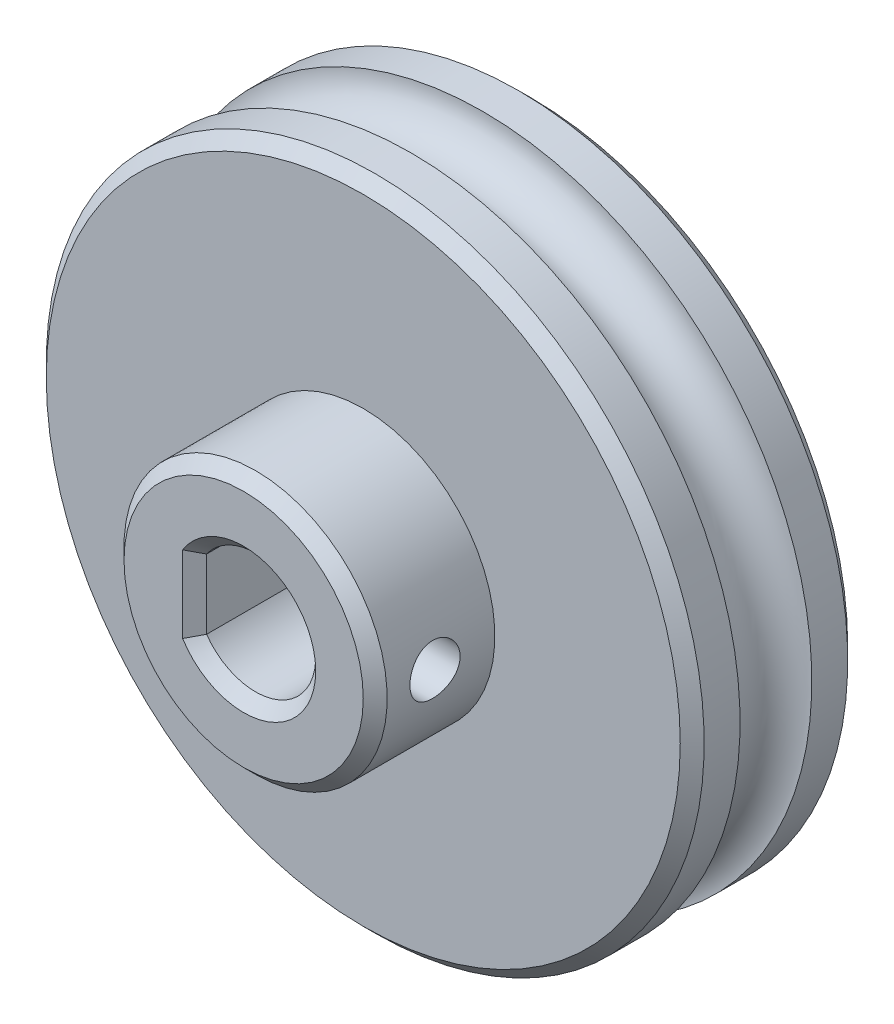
ISO-10303-21;
HEADER;
FILE_DESCRIPTION(('STEP AP214'),'2;1');
FILE_NAME('part.step','',(''),(''),'','','');
FILE_SCHEMA(('AUTOMOTIVE_DESIGN { 1 0 10303 214 1 1 1 1 }'));
ENDSEC;
DATA;
#1=APPLICATION_CONTEXT('core data for automotive mechanical design processes');
#2=APPLICATION_PROTOCOL_DEFINITION('international standard','automotive_design',2000,#1);
#3=PRODUCT_CONTEXT('',#1,'mechanical');
#4=PRODUCT('Part','Part','',(#3));
#5=PRODUCT_RELATED_PRODUCT_CATEGORY('part','',(#4));
#6=PRODUCT_DEFINITION_FORMATION('','',#4);
#7=PRODUCT_DEFINITION_CONTEXT('part definition',#1,'design');
#8=PRODUCT_DEFINITION('design','',#6,#7);
#9=PRODUCT_DEFINITION_SHAPE('','',#8);
#10=(LENGTH_UNIT() NAMED_UNIT(*) SI_UNIT(.MILLI.,.METRE.));
#11=(NAMED_UNIT(*) PLANE_ANGLE_UNIT() SI_UNIT($,.RADIAN.));
#12=(NAMED_UNIT(*) SI_UNIT($,.STERADIAN.) SOLID_ANGLE_UNIT());
#13=UNCERTAINTY_MEASURE_WITH_UNIT(LENGTH_MEASURE(1.E-05),#10,'distance_accuracy_value','');
#14=(GEOMETRIC_REPRESENTATION_CONTEXT(3) GLOBAL_UNCERTAINTY_ASSIGNED_CONTEXT((#13)) GLOBAL_UNIT_ASSIGNED_CONTEXT((#10,
#11,#12)) REPRESENTATION_CONTEXT('',''));
#15=CARTESIAN_POINT('',(0.,0.,0.));
#16=DIRECTION('',(0.,0.,1.));
#17=DIRECTION('',(1.,0.,0.));
#18=AXIS2_PLACEMENT_3D('',#15,#16,#17);
#19=CARTESIAN_POINT('',(0.,0.,85.9712445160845));
#20=DIRECTION('',(0.,0.,1.));
#21=DIRECTION('',(0.,-1.,0.));
#22=AXIS2_PLACEMENT_3D('',#19,#20,#21);
#23=CYLINDRICAL_SURFACE('',#22,11.);
#24=CARTESIAN_POINT('',(0.,0.,14.));
#25=DIRECTION('',(0.,0.,1.));
#26=DIRECTION('',(0.,-1.,0.));
#27=AXIS2_PLACEMENT_3D('',#24,#25,#26);
#28=CIRCLE('',#27,11.);
#29=CARTESIAN_POINT('',(0.,-11.,14.));
#30=VERTEX_POINT('',#29);
#31=EDGE_CURVE('E283',#30,#30,#28,.T.);
#32=ORIENTED_EDGE('',*,*,#31,.T.);
#33=EDGE_LOOP('',(#32));
#34=FACE_BOUND('',#33,.T.);
#35=CARTESIAN_POINT('',(0.,0.,23.));
#36=DIRECTION('',(0.,0.,1.));
#37=DIRECTION('',(0.,-1.,0.));
#38=AXIS2_PLACEMENT_3D('',#35,#36,#37);
#39=CIRCLE('',#38,11.);
#40=CARTESIAN_POINT('',(0.,-11.,23.));
#41=VERTEX_POINT('',#40);
#42=EDGE_CURVE('E251',#41,#41,#39,.F.);
#43=ORIENTED_EDGE('',*,*,#42,.T.);
#44=EDGE_LOOP('',(#43));
#45=FACE_BOUND('',#44,.T.);
#46=CARTESIAN_POINT('',(11.,0.,21.1));
#47=CARTESIAN_POINT('',(10.9999978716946,-0.116820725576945,21.0999955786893));
#48=CARTESIAN_POINT('',(10.9981198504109,-0.233698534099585,21.0902191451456));
#49=CARTESIAN_POINT('',(10.9908091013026,-0.46415790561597,21.0513984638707));
#50=CARTESIAN_POINT('',(10.9853734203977,-0.577736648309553,21.022338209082));
#51=CARTESIAN_POINT('',(10.971555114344,-0.798231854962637,20.9458743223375));
#52=CARTESIAN_POINT('',(10.9631751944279,-0.90515432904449,20.8984875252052));
#53=CARTESIAN_POINT('',(10.9443823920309,-1.10952197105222,20.7867640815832));
#54=CARTESIAN_POINT('',(10.9339696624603,-1.20696785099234,20.7224287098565));
#55=CARTESIAN_POINT('',(10.9121153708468,-1.39083315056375,20.5777881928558));
#56=CARTESIAN_POINT('',(10.9006636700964,-1.47711814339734,20.4973136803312));
#57=CARTESIAN_POINT('',(10.8780969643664,-1.63504914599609,20.3230435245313));
#58=CARTESIAN_POINT('',(10.8669819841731,-1.70669408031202,20.2292469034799));
#59=CARTESIAN_POINT('',(10.846248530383,-1.83387383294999,20.0300405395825));
#60=CARTESIAN_POINT('',(10.8366431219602,-1.88927125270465,19.9245415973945));
#61=CARTESIAN_POINT('',(10.8201595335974,-1.98150370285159,19.7055201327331));
#62=CARTESIAN_POINT('',(10.8132811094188,-2.01834039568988,19.5919983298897));
#63=CARTESIAN_POINT('',(10.8031324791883,-2.07197297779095,19.3615941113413));
#64=CARTESIAN_POINT('',(10.7998200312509,-2.08900368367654,19.2447682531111));
#65=CARTESIAN_POINT('',(10.7970511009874,-2.10326984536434,19.0098739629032));
#66=CARTESIAN_POINT('',(10.7975942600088,-2.10050714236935,18.8918056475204));
#67=CARTESIAN_POINT('',(10.8024367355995,-2.07545516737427,18.6594836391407));
#68=CARTESIAN_POINT('',(10.8066845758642,-2.05343348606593,18.5451998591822));
#69=CARTESIAN_POINT('',(10.8183768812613,-1.99091034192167,18.3219793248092));
#70=CARTESIAN_POINT('',(10.8258214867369,-1.95040806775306,18.213042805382));
#71=CARTESIAN_POINT('',(10.8431219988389,-1.85181340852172,18.0028292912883));
#72=CARTESIAN_POINT('',(10.8529925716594,-1.79361350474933,17.901603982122));
#73=CARTESIAN_POINT('',(10.8740232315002,-1.66135166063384,17.7102553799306));
#74=CARTESIAN_POINT('',(10.8851834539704,-1.58728805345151,17.6201332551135));
#75=CARTESIAN_POINT('',(10.9077598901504,-1.42396113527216,17.4520037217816));
#76=CARTESIAN_POINT('',(10.9191773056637,-1.33446907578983,17.3742185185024));
#77=CARTESIAN_POINT('',(10.9408141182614,-1.14358963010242,17.2347307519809));
#78=CARTESIAN_POINT('',(10.9510335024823,-1.04220211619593,17.1730283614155));
#79=CARTESIAN_POINT('',(10.9691445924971,-0.830173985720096,17.0674227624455));
#80=CARTESIAN_POINT('',(10.9770331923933,-0.719521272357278,17.0235432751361));
#81=CARTESIAN_POINT('',(10.9895700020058,-0.49223122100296,16.9550569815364));
#82=CARTESIAN_POINT('',(10.994218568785,-0.37559454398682,16.9304480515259));
#83=CARTESIAN_POINT('',(10.9997023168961,-0.141558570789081,16.9015121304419));
#84=CARTESIAN_POINT('',(11.0005947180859,-0.0241982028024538,16.8968807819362));
#85=CARTESIAN_POINT('',(10.9986238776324,0.209619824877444,16.9072142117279));
#86=CARTESIAN_POINT('',(10.9957608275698,0.326077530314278,16.9221779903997));
#87=CARTESIAN_POINT('',(10.9866364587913,0.553814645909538,16.9710239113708));
#88=CARTESIAN_POINT('',(10.9804029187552,0.665128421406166,17.0047514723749));
#89=CARTESIAN_POINT('',(10.9652337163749,0.880521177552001,17.0899998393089));
#90=CARTESIAN_POINT('',(10.9562978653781,0.984599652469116,17.1415218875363));
#91=CARTESIAN_POINT('',(10.9365725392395,1.18386224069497,17.2615662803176));
#92=CARTESIAN_POINT('',(10.9257632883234,1.27893275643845,17.3302738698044));
#93=CARTESIAN_POINT('',(10.9035399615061,1.45630391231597,17.4824890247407));
#94=CARTESIAN_POINT('',(10.8921258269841,1.53860331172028,17.5659980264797));
#95=CARTESIAN_POINT('',(10.8697885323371,1.68925742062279,17.7468254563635));
#96=CARTESIAN_POINT('',(10.8588743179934,1.7574040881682,17.8443185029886));
#97=CARTESIAN_POINT('',(10.8389551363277,1.87635388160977,18.0495468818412));
#98=CARTESIAN_POINT('',(10.8299500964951,1.92715766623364,18.157281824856));
#99=CARTESIAN_POINT('',(10.8149396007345,2.00968750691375,18.3794169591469));
#100=CARTESIAN_POINT('',(10.8089194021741,2.04150748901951,18.4937812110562));
#101=CARTESIAN_POINT('',(10.8005271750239,2.08545491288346,18.7263589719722));
#102=CARTESIAN_POINT('',(10.7981547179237,2.09758466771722,18.844572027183));
#103=CARTESIAN_POINT('',(10.7973488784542,2.10172771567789,19.0794065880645));
#104=CARTESIAN_POINT('',(10.7988512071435,2.09406932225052,19.1960222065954));
#105=CARTESIAN_POINT('',(10.8054828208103,2.0595738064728,19.4262709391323));
#106=CARTESIAN_POINT('',(10.8106120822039,2.03273680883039,19.5399040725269));
#107=CARTESIAN_POINT('',(10.8238920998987,1.96078655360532,19.7607769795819));
#108=CARTESIAN_POINT('',(10.8320367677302,1.91571010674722,19.8680291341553));
#109=CARTESIAN_POINT('',(10.8504339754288,1.80859687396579,20.0735005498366));
#110=CARTESIAN_POINT('',(10.8606866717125,1.74655882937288,20.1717191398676));
#111=CARTESIAN_POINT('',(10.882343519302,1.60614737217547,20.3579773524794));
#112=CARTESIAN_POINT('',(10.8937630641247,1.5275355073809,20.4458354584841));
#113=CARTESIAN_POINT('',(10.9163530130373,1.35670385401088,20.6072225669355));
#114=CARTESIAN_POINT('',(10.9275233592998,1.26448094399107,20.6807482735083));
#115=CARTESIAN_POINT('',(10.9484794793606,1.06800710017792,20.8120301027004));
#116=CARTESIAN_POINT('',(10.9582512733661,0.963651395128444,20.8696317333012));
#117=CARTESIAN_POINT('',(10.9751724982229,0.746588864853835,20.966392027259));
#118=CARTESIAN_POINT('',(10.9823243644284,0.633889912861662,21.0055678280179));
#119=CARTESIAN_POINT('',(10.9917600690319,0.434066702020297,21.056507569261));
#120=CARTESIAN_POINT('',(10.9948324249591,0.348102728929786,21.0727890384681));
#121=CARTESIAN_POINT('',(10.9989531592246,0.174769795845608,21.0945367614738));
#122=CARTESIAN_POINT('',(11.0000015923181,0.0874008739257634,21.1000033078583));
#123=CARTESIAN_POINT('',(11.,0.,21.1));
#124=B_SPLINE_CURVE_WITH_KNOTS('',3,(#46,#47,#48,#49,#50,#51,#52,#53,#54,#55,#56,#57,#58,#59,
#60,#61,#62,#63,#64,#65,#66,#67,#68,#69,#70,#71,#72,#73,#74,#75,#76,#77,#78,#79,#80,#81,#82,#83,
#84,#85,#86,#87,#88,#89,#90,#91,#92,#93,#94,#95,#96,#97,#98,#99,#100,#101,#102,#103,#104,#105,
#106,#107,#108,#109,#110,#111,#112,#113,#114,#115,#116,#117,#118,#119,#120,#121,#122,#123),
.UNSPECIFIED.,.T.,.F.,(4,2,2,2,2,2,2,2,2,2,2,2,2,2,2,2,2,2,2,2,2,2,2,2,2,2,2,2,2,2,2,2,2,2,2,2,
2,2,4),(0.,0.350142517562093,0.700576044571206,1.05068842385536,1.40077447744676,
1.75474719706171,2.10874590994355,2.46565720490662,2.82253652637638,3.17514016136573,
3.52771099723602,3.87545955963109,4.2232233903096,4.57314370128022,4.92310079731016,
5.27878057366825,5.63446416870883,5.99061961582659,6.34673580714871,6.6974069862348,
7.04806027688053,7.39586667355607,7.74369735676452,8.09545238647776,8.447241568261,
8.80388396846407,9.16051282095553,9.51536222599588,9.87016994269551,10.2191288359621,
10.5680854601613,10.9163413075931,11.2646230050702,11.6183069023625,11.9720720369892,
12.3291576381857,12.6859104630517,12.9478810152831,13.2098444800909),.UNSPECIFIED.);
#125=CARTESIAN_POINT('',(11.,0.,21.1));
#126=VERTEX_POINT('',#125);
#127=EDGE_CURVE('E170',#126,#126,#124,.T.);
#128=ORIENTED_EDGE('',*,*,#127,.F.);
#129=EDGE_LOOP('',(#128));
#130=FACE_BOUND('',#129,.T.);
#131=ADVANCED_FACE('F41',(#34,#45,#130),#23,.T.);
#132=CARTESIAN_POINT('',(0.,0.,0.));
#133=DIRECTION('',(0.,0.,1.));
#134=DIRECTION('',(1.,0.,0.));
#135=AXIS2_PLACEMENT_3D('',#132,#133,#134);
#136=CYLINDRICAL_SURFACE('',#135,5.02499999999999);
#137=DIRECTION('',(0.,0.,1.));
#138=VECTOR('',#137,1.);
#139=CARTESIAN_POINT('',(-4.1,2.90527537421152,0.));
#140=LINE('',#139,#138);
#141=CARTESIAN_POINT('',(-4.1,2.90527537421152,0.999999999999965));
#142=VERTEX_POINT('',#141);
#143=CARTESIAN_POINT('',(-4.1,2.90527537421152,23.));
#144=VERTEX_POINT('',#143);
#145=EDGE_CURVE('E286',#142,#144,#140,.T.);
#146=ORIENTED_EDGE('',*,*,#145,.F.);
#147=CARTESIAN_POINT('',(0.,0.,0.999999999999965));
#148=DIRECTION('',(0.,0.,-1.));
#149=DIRECTION('',(-1.,0.,0.));
#150=AXIS2_PLACEMENT_3D('',#147,#148,#149);
#151=CIRCLE('',#150,5.02499999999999);
#152=CARTESIAN_POINT('',(-4.1,-2.90527537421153,0.999999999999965));
#153=VERTEX_POINT('',#152);
#154=EDGE_CURVE('E124',#142,#153,#151,.T.);
#155=ORIENTED_EDGE('',*,*,#154,.T.);
#156=DIRECTION('',(0.,0.,1.));
#157=VECTOR('',#156,1.);
#158=CARTESIAN_POINT('',(-4.1,-2.90527537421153,0.));
#159=LINE('',#158,#157);
#160=CARTESIAN_POINT('',(-4.1,-2.90527537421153,23.));
#161=VERTEX_POINT('',#160);
#162=EDGE_CURVE('E187',#153,#161,#159,.T.);
#163=ORIENTED_EDGE('',*,*,#162,.T.);
#164=CARTESIAN_POINT('',(0.,0.,23.));
#165=DIRECTION('',(0.,0.,1.));
#166=DIRECTION('',(1.,0.,0.));
#167=AXIS2_PLACEMENT_3D('',#164,#165,#166);
#168=CIRCLE('',#167,5.02499999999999);
#169=EDGE_CURVE('E121',#161,#144,#168,.T.);
#170=ORIENTED_EDGE('',*,*,#169,.T.);
#171=EDGE_LOOP('',(#146,#155,#163,#170));
#172=FACE_BOUND('',#171,.T.);
#173=CARTESIAN_POINT('',(5.02499999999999,0.,21.1));
#174=CARTESIAN_POINT('',(5.02499341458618,0.112469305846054,21.0999913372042));
#175=CARTESIAN_POINT('',(5.02118163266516,0.225099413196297,21.0909135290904));
#176=CARTESIAN_POINT('',(5.00630803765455,0.447173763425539,21.0549336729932));
#177=CARTESIAN_POINT('',(4.9952273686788,0.556608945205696,21.0279852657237));
#178=CARTESIAN_POINT('',(4.96700327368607,0.768706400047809,20.9574305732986));
#179=CARTESIAN_POINT('',(4.94988045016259,0.871390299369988,20.9138808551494));
#180=CARTESIAN_POINT('',(4.9112386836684,1.06789550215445,20.8115950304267));
#181=CARTESIAN_POINT('',(4.88972105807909,1.16171944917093,20.7528634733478));
#182=CARTESIAN_POINT('',(4.84322728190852,1.3427235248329,20.6187520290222));
#183=CARTESIAN_POINT('',(4.81813742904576,1.42939804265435,20.5427295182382));
#184=CARTESIAN_POINT('',(4.76781849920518,1.58920245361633,20.3775531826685));
#185=CARTESIAN_POINT('',(4.74258935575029,1.66232517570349,20.2883924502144));
#186=CARTESIAN_POINT('',(4.69344890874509,1.79653224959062,20.0941140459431));
#187=CARTESIAN_POINT('',(4.6696649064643,1.85684026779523,19.9884245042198));
#188=CARTESIAN_POINT('',(4.62791221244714,1.95859675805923,19.7672634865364));
#189=CARTESIAN_POINT('',(4.60994050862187,2.000055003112,19.6517971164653));
#190=CARTESIAN_POINT('',(4.58307859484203,2.06084406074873,19.4201797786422));
#191=CARTESIAN_POINT('',(4.57379111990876,2.0811482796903,19.3043321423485));
#192=CARTESIAN_POINT('',(4.56420767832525,2.10208945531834,19.0705305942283));
#193=CARTESIAN_POINT('',(4.56390671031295,2.10273735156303,18.9525778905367));
#194=CARTESIAN_POINT('',(4.57199428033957,2.08508034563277,18.7276371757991));
#195=CARTESIAN_POINT('',(4.57971373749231,2.06823483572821,18.6205057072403));
#196=CARTESIAN_POINT('',(4.60184110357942,2.01851824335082,18.4107583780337));
#197=CARTESIAN_POINT('',(4.61625030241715,1.98564407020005,18.3081433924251));
#198=CARTESIAN_POINT('',(4.65045957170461,1.90416163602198,18.1077426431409));
#199=CARTESIAN_POINT('',(4.6703681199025,1.85523258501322,18.0101066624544));
#200=CARTESIAN_POINT('',(4.71330802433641,1.74325626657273,17.824049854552));
#201=CARTESIAN_POINT('',(4.73634061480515,1.68020341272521,17.7356326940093));
#202=CARTESIAN_POINT('',(4.78531682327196,1.53547328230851,17.5626072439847));
#203=CARTESIAN_POINT('',(4.81134140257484,1.45266797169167,17.4789627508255));
#204=CARTESIAN_POINT('',(4.8617170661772,1.27394895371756,17.3264230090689));
#205=CARTESIAN_POINT('',(4.88606775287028,1.1780321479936,17.2575312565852));
#206=CARTESIAN_POINT('',(4.93106670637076,0.972869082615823,17.1350276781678));
#207=CARTESIAN_POINT('',(4.95161526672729,0.863363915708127,17.0818101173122));
#208=CARTESIAN_POINT('',(4.9859285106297,0.63587712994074,16.9948907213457));
#209=CARTESIAN_POINT('',(4.99969696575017,0.517900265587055,16.9611780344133));
#210=CARTESIAN_POINT('',(5.01819281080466,0.28487141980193,16.9162477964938));
#211=CARTESIAN_POINT('',(5.02343910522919,0.170109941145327,16.9037369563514));
#212=CARTESIAN_POINT('',(5.02595749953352,-0.0599832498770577,16.8977070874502));
#213=CARTESIAN_POINT('',(5.02323190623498,-0.175314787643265,16.9041825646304));
#214=CARTESIAN_POINT('',(5.01044905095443,-0.397203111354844,16.93501762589));
#215=CARTESIAN_POINT('',(5.00076509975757,-0.503910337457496,16.9584670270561));
#216=CARTESIAN_POINT('',(4.97543906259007,-0.711758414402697,17.0213153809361));
#217=CARTESIAN_POINT('',(4.95979622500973,-0.812898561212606,17.0607163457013));
#218=CARTESIAN_POINT('',(4.92344658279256,-1.01029136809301,17.1556359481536));
#219=CARTESIAN_POINT('',(4.90259746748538,-1.1062943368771,17.2116175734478));
#220=CARTESIAN_POINT('',(4.8580578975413,-1.28788753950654,17.3376008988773));
#221=CARTESIAN_POINT('',(4.83436625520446,-1.37347339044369,17.4076084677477));
#222=CARTESIAN_POINT('',(4.78458847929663,-1.53826935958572,17.5655422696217));
#223=CARTESIAN_POINT('',(4.75845263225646,-1.6165790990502,17.6543947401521));
#224=CARTESIAN_POINT('',(4.70825547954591,-1.75743002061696,17.844393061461));
#225=CARTESIAN_POINT('',(4.68419465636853,-1.81996754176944,17.9455417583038));
#226=CARTESIAN_POINT('',(4.64070570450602,-1.92819659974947,18.1593940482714));
#227=CARTESIAN_POINT('',(4.62135040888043,-1.97362862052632,18.2722448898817));
#228=CARTESIAN_POINT('',(4.59046194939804,-2.04445712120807,18.5050584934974));
#229=CARTESIAN_POINT('',(4.5789222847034,-2.0698702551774,18.6250152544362));
#230=CARTESIAN_POINT('',(4.56596846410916,-2.09827985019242,18.8586386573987));
#231=CARTESIAN_POINT('',(4.56384019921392,-2.1028580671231,18.9720742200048));
#232=CARTESIAN_POINT('',(4.56805094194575,-2.09369577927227,19.1980310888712));
#233=CARTESIAN_POINT('',(4.57438863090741,-2.07995812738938,19.3105525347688));
#234=CARTESIAN_POINT('',(4.59416282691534,-2.03588533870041,19.5260234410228));
#235=CARTESIAN_POINT('',(4.60725084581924,-2.00636259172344,19.6291741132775));
#236=CARTESIAN_POINT('',(4.63877565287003,-1.93235471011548,19.8290803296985));
#237=CARTESIAN_POINT('',(4.65721394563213,-1.88786536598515,19.925834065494));
#238=CARTESIAN_POINT('',(4.69874088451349,-1.78209634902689,20.1165718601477));
#239=CARTESIAN_POINT('',(4.72204297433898,-1.71996565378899,20.2100366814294));
#240=CARTESIAN_POINT('',(4.77007979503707,-1.58186797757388,20.3857088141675));
#241=CARTESIAN_POINT('',(4.79481502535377,-1.50589615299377,20.4679121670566));
#242=CARTESIAN_POINT('',(4.84511322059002,-1.33563869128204,20.6249417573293));
#243=CARTESIAN_POINT('',(4.87060352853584,-1.24041773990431,20.6987825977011));
#244=CARTESIAN_POINT('',(4.91771618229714,-1.03802410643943,20.8294893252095));
#245=CARTESIAN_POINT('',(4.93933676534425,-0.930846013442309,20.8863474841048));
#246=CARTESIAN_POINT('',(4.97596320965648,-0.709072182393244,20.9802626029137));
#247=CARTESIAN_POINT('',(4.99107140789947,-0.594626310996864,21.0176280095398));
#248=CARTESIAN_POINT('',(5.00783241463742,-0.419187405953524,21.0586160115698));
#249=CARTESIAN_POINT('',(5.01243440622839,-0.360133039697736,21.0697654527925));
#250=CARTESIAN_POINT('',(5.01956100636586,-0.241172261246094,21.0869678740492));
#251=CARTESIAN_POINT('',(5.02208697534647,-0.18126643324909,21.093024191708));
#252=CARTESIAN_POINT('',(5.02451278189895,-0.0808585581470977,21.0988337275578));
#253=CARTESIAN_POINT('',(5.02500236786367,-0.0404396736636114,21.100003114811));
#254=CARTESIAN_POINT('',(5.02499999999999,0.,21.1));
#255=B_SPLINE_CURVE_WITH_KNOTS('',3,(#173,#174,#175,#176,#177,#178,#179,#180,#181,#182,#183,
#184,#185,#186,#187,#188,#189,#190,#191,#192,#193,#194,#195,#196,#197,#198,#199,#200,#201,#202,
#203,#204,#205,#206,#207,#208,#209,#210,#211,#212,#213,#214,#215,#216,#217,#218,#219,#220,#221,
#222,#223,#224,#225,#226,#227,#228,#229,#230,#231,#232,#233,#234,#235,#236,#237,#238,#239,#240,
#241,#242,#243,#244,#245,#246,#247,#248,#249,#250,#251,#252,#253,#254),.UNSPECIFIED.,.T.,.F.,(4,
2,2,2,2,2,2,2,2,2,2,2,2,2,2,2,2,2,2,2,2,2,2,2,2,2,2,2,2,2,2,2,2,2,2,2,2,2,2,2,4),(0.,
0.337267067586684,0.675412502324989,1.01241589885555,1.34931842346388,1.7017507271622,
2.05436899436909,2.424465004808,2.79436891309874,3.14637851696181,3.49819220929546,
3.82284406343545,4.14755854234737,4.47920232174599,4.81097750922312,5.17097521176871,
5.53105813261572,5.89954738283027,6.26783142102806,6.61271352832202,6.95749584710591,
7.2850429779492,7.61263143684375,7.95040398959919,8.28831816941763,8.65051966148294,
9.01280514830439,9.38038454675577,9.74765782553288,10.0865250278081,10.4253394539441,
10.7481924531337,11.0711363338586,11.4135631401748,11.7561100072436,12.1238181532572,
12.4916933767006,12.8535559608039,13.034169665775,13.2146649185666,13.3359332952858),.UNSPECIFIED.);
#256=CARTESIAN_POINT('',(5.02499999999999,0.,21.1));
#257=VERTEX_POINT('',#256);
#258=EDGE_CURVE('E164',#257,#257,#255,.T.);
#259=ORIENTED_EDGE('',*,*,#258,.F.);
#260=EDGE_LOOP('',(#259));
#261=FACE_BOUND('',#260,.T.);
#262=ADVANCED_FACE('F189',(#172,#261),#136,.F.);
#263=CARTESIAN_POINT('',(0.,0.,0.));
#264=DIRECTION('',(0.,0.,-1.));
#265=DIRECTION('',(0.,1.,0.));
#266=AXIS2_PLACEMENT_3D('',#263,#264,#265);
#267=PLANE('',#266);
#268=CARTESIAN_POINT('',(0.,0.,0.));
#269=DIRECTION('',(0.,0.,-1.));
#270=DIRECTION('',(0.,1.,0.));
#271=AXIS2_PLACEMENT_3D('',#268,#269,#270);
#272=CIRCLE('',#271,6.02499999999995);
#273=CARTESIAN_POINT('',(-5.09999999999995,-3.20790040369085,0.));
#274=VERTEX_POINT('',#273);
#275=CARTESIAN_POINT('',(-5.09999999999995,3.20790040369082,0.));
#276=VERTEX_POINT('',#275);
#277=EDGE_CURVE('E103',#274,#276,#272,.F.);
#278=ORIENTED_EDGE('',*,*,#277,.T.);
#279=DIRECTION('',(0.,-1.,0.));
#280=VECTOR('',#279,1.);
#281=CARTESIAN_POINT('',(-5.09999999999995,-2.90527537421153,0.));
#282=LINE('',#281,#280);
#283=EDGE_CURVE('E94',#276,#274,#282,.T.);
#284=ORIENTED_EDGE('',*,*,#283,.T.);
#285=EDGE_LOOP('',(#278,#284));
#286=FACE_BOUND('',#285,.T.);
#287=CARTESIAN_POINT('',(0.,0.,0.));
#288=DIRECTION('',(0.,0.,-1.));
#289=DIRECTION('',(0.,1.,0.));
#290=AXIS2_PLACEMENT_3D('',#287,#288,#289);
#291=CIRCLE('',#290,26.5);
#292=CARTESIAN_POINT('',(0.,26.4999999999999,0.));
#293=VERTEX_POINT('',#292);
#294=EDGE_CURVE('E107',#293,#293,#291,.T.);
#295=ORIENTED_EDGE('',*,*,#294,.T.);
#296=EDGE_LOOP('',(#295));
#297=FACE_BOUND('',#296,.T.);
#298=ADVANCED_FACE('F109',(#286,#297),#267,.T.);
#299=CARTESIAN_POINT('',(0.,-11.,24.));
#300=DIRECTION('',(0.,0.,1.));
#301=DIRECTION('',(0.,-1.,0.));
#302=AXIS2_PLACEMENT_3D('',#299,#300,#301);
#303=PLANE('',#302);
#304=CARTESIAN_POINT('',(0.,0.,24.));
#305=DIRECTION('',(0.,0.,1.));
#306=DIRECTION('',(0.,-1.,0.));
#307=AXIS2_PLACEMENT_3D('',#304,#305,#306);
#308=CIRCLE('',#307,6.02500000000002);
#309=CARTESIAN_POINT('',(-5.10000000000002,3.20790040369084,24.));
#310=VERTEX_POINT('',#309);
#311=CARTESIAN_POINT('',(-5.10000000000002,-3.20790040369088,24.));
#312=VERTEX_POINT('',#311);
#313=EDGE_CURVE('E57',#310,#312,#308,.F.);
#314=ORIENTED_EDGE('',*,*,#313,.T.);
#315=DIRECTION('',(0.,1.,0.));
#316=VECTOR('',#315,1.);
#317=CARTESIAN_POINT('',(-5.10000000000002,2.90527537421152,24.));
#318=LINE('',#317,#316);
#319=EDGE_CURVE('E11',#312,#310,#318,.T.);
#320=ORIENTED_EDGE('',*,*,#319,.T.);
#321=EDGE_LOOP('',(#314,#320));
#322=FACE_BOUND('',#321,.T.);
#323=CARTESIAN_POINT('',(0.,0.,24.));
#324=DIRECTION('',(0.,0.,1.));
#325=DIRECTION('',(0.,-1.,0.));
#326=AXIS2_PLACEMENT_3D('',#323,#324,#325);
#327=CIRCLE('',#326,10.);
#328=CARTESIAN_POINT('',(0.,-10.0000000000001,24.));
#329=VERTEX_POINT('',#328);
#330=EDGE_CURVE('E258',#329,#329,#327,.T.);
#331=ORIENTED_EDGE('',*,*,#330,.T.);
#332=EDGE_LOOP('',(#331));
#333=FACE_BOUND('',#332,.T.);
#334=ADVANCED_FACE('F220',(#322,#333),#303,.T.);
#335=CARTESIAN_POINT('',(0.,-27.5,14.));
#336=DIRECTION('',(0.,0.,1.));
#337=DIRECTION('',(0.,-1.,0.));
#338=AXIS2_PLACEMENT_3D('',#335,#336,#337);
#339=PLANE('',#338);
#340=CARTESIAN_POINT('',(0.,0.,14.));
#341=DIRECTION('',(0.,0.,1.));
#342=DIRECTION('',(0.,-1.,0.));
#343=AXIS2_PLACEMENT_3D('',#340,#341,#342);
#344=CIRCLE('',#343,26.5);
#345=CARTESIAN_POINT('',(0.,-26.5,14.));
#346=VERTEX_POINT('',#345);
#347=EDGE_CURVE('E248',#346,#346,#344,.T.);
#348=ORIENTED_EDGE('',*,*,#347,.T.);
#349=EDGE_LOOP('',(#348));
#350=FACE_BOUND('',#349,.T.);
#351=ORIENTED_EDGE('',*,*,#31,.F.);
#352=EDGE_LOOP('',(#351));
#353=FACE_BOUND('',#352,.T.);
#354=ADVANCED_FACE('F218',(#350,#353),#339,.T.);
#355=CARTESIAN_POINT('',(0.,0.,85.9712445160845));
#356=DIRECTION('',(0.,0.,1.));
#357=DIRECTION('',(0.,-1.,0.));
#358=AXIS2_PLACEMENT_3D('',#355,#356,#357);
#359=CYLINDRICAL_SURFACE('',#358,27.5);
#360=CARTESIAN_POINT('',(0.,0.,13.));
#361=DIRECTION('',(0.,0.,1.));
#362=DIRECTION('',(0.,-1.,0.));
#363=AXIS2_PLACEMENT_3D('',#360,#361,#362);
#364=CIRCLE('',#363,27.5);
#365=CARTESIAN_POINT('',(0.,-27.5,13.));
#366=VERTEX_POINT('',#365);
#367=EDGE_CURVE('E245',#366,#366,#364,.F.);
#368=ORIENTED_EDGE('',*,*,#367,.T.);
#369=EDGE_LOOP('',(#368));
#370=FACE_BOUND('',#369,.T.);
#371=CARTESIAN_POINT('',(0.,0.,10.));
#372=DIRECTION('',(0.,0.,1.));
#373=DIRECTION('',(0.,-1.,0.));
#374=AXIS2_PLACEMENT_3D('',#371,#372,#373);
#375=CIRCLE('',#374,27.5);
#376=CARTESIAN_POINT('',(0.,-27.5,10.));
#377=VERTEX_POINT('',#376);
#378=EDGE_CURVE('E278',#377,#377,#375,.T.);
#379=ORIENTED_EDGE('',*,*,#378,.T.);
#380=EDGE_LOOP('',(#379));
#381=FACE_BOUND('',#380,.T.);
#382=ADVANCED_FACE('F297',(#370,#381),#359,.T.);
#383=CARTESIAN_POINT('',(0.,0.,7.00000000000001));
#384=DIRECTION('',(0.,0.,1.));
#385=DIRECTION('',(0.,-1.,0.));
#386=AXIS2_PLACEMENT_3D('',#383,#384,#385);
#387=TOROIDAL_SURFACE('',#386,27.5,3.);
#388=CARTESIAN_POINT('',(0.,0.,4.00000000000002));
#389=DIRECTION('',(0.,0.,1.));
#390=DIRECTION('',(0.,-1.,0.));
#391=AXIS2_PLACEMENT_3D('',#388,#389,#390);
#392=CIRCLE('',#391,27.5);
#393=CARTESIAN_POINT('',(0.,-27.5,4.00000000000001));
#394=VERTEX_POINT('',#393);
#395=EDGE_CURVE('E275',#394,#394,#392,.T.);
#396=ORIENTED_EDGE('',*,*,#395,.T.);
#397=EDGE_LOOP('',(#396));
#398=FACE_BOUND('',#397,.T.);
#399=ORIENTED_EDGE('',*,*,#378,.F.);
#400=EDGE_LOOP('',(#399));
#401=FACE_BOUND('',#400,.T.);
#402=ADVANCED_FACE('F272',(#398,#401),#387,.F.);
#403=CARTESIAN_POINT('',(0.,0.,85.9712445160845));
#404=DIRECTION('',(0.,0.,1.));
#405=DIRECTION('',(0.,-1.,0.));
#406=AXIS2_PLACEMENT_3D('',#403,#404,#405);
#407=CYLINDRICAL_SURFACE('',#406,27.5);
#408=CARTESIAN_POINT('',(0.,0.,1.00000000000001));
#409=DIRECTION('',(0.,0.,-1.));
#410=DIRECTION('',(0.,1.,0.));
#411=AXIS2_PLACEMENT_3D('',#408,#409,#410);
#412=CIRCLE('',#411,27.5);
#413=CARTESIAN_POINT('',(0.,27.5,1.00000000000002));
#414=VERTEX_POINT('',#413);
#415=EDGE_CURVE('E255',#414,#414,#412,.F.);
#416=ORIENTED_EDGE('',*,*,#415,.T.);
#417=EDGE_LOOP('',(#416));
#418=FACE_BOUND('',#417,.T.);
#419=ORIENTED_EDGE('',*,*,#395,.F.);
#420=EDGE_LOOP('',(#419));
#421=FACE_BOUND('',#420,.T.);
#422=ADVANCED_FACE('F232',(#418,#421),#407,.T.);
#423=CARTESIAN_POINT('',(0.,0.,24.));
#424=DIRECTION('',(0.,0.,-1.));
#425=DIRECTION('',(0.,1.,0.));
#426=AXIS2_PLACEMENT_3D('',#423,#424,#425);
#427=CONICAL_SURFACE('',#426,10.,0.785398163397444);
#428=ORIENTED_EDGE('',*,*,#42,.F.);
#429=EDGE_LOOP('',(#428));
#430=FACE_BOUND('',#429,.T.);
#431=ORIENTED_EDGE('',*,*,#330,.F.);
#432=EDGE_LOOP('',(#431));
#433=FACE_BOUND('',#432,.T.);
#434=ADVANCED_FACE('F226',(#430,#433),#427,.T.);
#435=CARTESIAN_POINT('',(0.,0.,14.));
#436=DIRECTION('',(0.,0.,-1.));
#437=DIRECTION('',(0.,1.,0.));
#438=AXIS2_PLACEMENT_3D('',#435,#436,#437);
#439=CONICAL_SURFACE('',#438,26.5,0.785398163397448);
#440=ORIENTED_EDGE('',*,*,#367,.F.);
#441=EDGE_LOOP('',(#440));
#442=FACE_BOUND('',#441,.T.);
#443=ORIENTED_EDGE('',*,*,#347,.F.);
#444=EDGE_LOOP('',(#443));
#445=FACE_BOUND('',#444,.T.);
#446=ADVANCED_FACE('F204',(#442,#445),#439,.T.);
#447=CARTESIAN_POINT('',(0.,0.,1.00000000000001));
#448=DIRECTION('',(0.,0.,1.));
#449=DIRECTION('',(0.,-1.,0.));
#450=AXIS2_PLACEMENT_3D('',#447,#448,#449);
#451=CONICAL_SURFACE('',#450,27.5,0.78539816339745);
#452=ORIENTED_EDGE('',*,*,#294,.F.);
#453=EDGE_LOOP('',(#452));
#454=FACE_BOUND('',#453,.T.);
#455=ORIENTED_EDGE('',*,*,#415,.F.);
#456=EDGE_LOOP('',(#455));
#457=FACE_BOUND('',#456,.T.);
#458=ADVANCED_FACE('F199',(#454,#457),#451,.T.);
#459=CARTESIAN_POINT('',(-4.1,2.90527537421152,0.));
#460=DIRECTION('',(-1.,0.,0.));
#461=DIRECTION('',(0.,0.,1.));
#462=AXIS2_PLACEMENT_3D('',#459,#460,#461);
#463=PLANE('',#462);
#464=ORIENTED_EDGE('',*,*,#162,.F.);
#465=DIRECTION('',(0.,1.,0.));
#466=VECTOR('',#465,1.);
#467=CARTESIAN_POINT('',(-4.1,2.90527537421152,0.999999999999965));
#468=LINE('',#467,#466);
#469=EDGE_CURVE('E96',#153,#142,#468,.T.);
#470=ORIENTED_EDGE('',*,*,#469,.T.);
#471=ORIENTED_EDGE('',*,*,#145,.T.);
#472=DIRECTION('',(0.,-1.,0.));
#473=VECTOR('',#472,1.);
#474=CARTESIAN_POINT('',(-4.1,-2.90527537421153,23.));
#475=LINE('',#474,#473);
#476=EDGE_CURVE('E112',#144,#161,#475,.T.);
#477=ORIENTED_EDGE('',*,*,#476,.T.);
#478=EDGE_LOOP('',(#464,#470,#471,#477));
#479=FACE_BOUND('',#478,.T.);
#480=ADVANCED_FACE('F148',(#479),#463,.F.);
#481=CARTESIAN_POINT('',(0.,0.,0.));
#482=DIRECTION('',(0.,0.,-1.));
#483=DIRECTION('',(-1.,0.,0.));
#484=AXIS2_PLACEMENT_3D('',#481,#482,#483);
#485=CONICAL_SURFACE('',#484,6.02499999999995,0.785398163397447);
#486=CARTESIAN_POINT('',(-5.09999999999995,-3.20790040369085,0.));
#487=CARTESIAN_POINT('',(-5.01649601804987,-3.18382127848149,0.0835039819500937));
#488=CARTESIAN_POINT('',(-4.93302924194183,-3.15948317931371,0.166970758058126));
#489=CARTESIAN_POINT('',(-4.76617988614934,-3.11025156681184,0.333820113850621));
#490=CARTESIAN_POINT('',(-4.68279730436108,-3.08535806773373,0.417202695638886));
#491=CARTESIAN_POINT('',(-4.51612137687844,-3.03497681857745,0.583878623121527));
#492=CARTESIAN_POINT('',(-4.43282803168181,-3.00948906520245,0.667171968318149));
#493=CARTESIAN_POINT('',(-4.2663383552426,-2.95787347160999,0.833661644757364));
#494=CARTESIAN_POINT('',(-4.18314202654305,-2.93174561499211,0.916857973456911));
#495=CARTESIAN_POINT('',(-4.1,-2.90527537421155,0.999999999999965));
#496=B_SPLINE_CURVE_WITH_KNOTS('',3,(#486,#487,#488,#489,#490,#491,#492,#493,#494,#495),
.UNSPECIFIED.,.F.,.F.,(4,2,2,2,4),(0.,0.361566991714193,0.723124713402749,1.08468444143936,
1.44625344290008),.UNSPECIFIED.);
#497=EDGE_CURVE('E90',#153,#274,#496,.F.);
#498=ORIENTED_EDGE('',*,*,#497,.F.);
#499=ORIENTED_EDGE('',*,*,#154,.F.);
#500=CARTESIAN_POINT('',(-4.1,2.90527537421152,0.999999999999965));
#501=CARTESIAN_POINT('',(-4.18314202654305,2.93174561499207,0.916857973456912));
#502=CARTESIAN_POINT('',(-4.2663383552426,2.95787347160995,0.833661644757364));
#503=CARTESIAN_POINT('',(-4.43282803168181,3.00948906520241,0.667171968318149));
#504=CARTESIAN_POINT('',(-4.51612137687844,3.03497681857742,0.583878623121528));
#505=CARTESIAN_POINT('',(-4.68279730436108,3.08535806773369,0.417202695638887));
#506=CARTESIAN_POINT('',(-4.76617988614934,3.1102515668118,0.333820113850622));
#507=CARTESIAN_POINT('',(-4.93302924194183,3.15948317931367,0.166970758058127));
#508=CARTESIAN_POINT('',(-5.01649601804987,3.18382127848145,0.0835039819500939));
#509=CARTESIAN_POINT('',(-5.09999999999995,3.20790040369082,0.));
#510=B_SPLINE_CURVE_WITH_KNOTS('',3,(#500,#501,#502,#503,#504,#505,#506,#507,#508,#509),
.UNSPECIFIED.,.F.,.F.,(4,2,2,2,4),(0.,0.361569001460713,0.723128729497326,1.08468645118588,
1.44625344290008),.UNSPECIFIED.);
#511=EDGE_CURVE('E100',#276,#142,#510,.F.);
#512=ORIENTED_EDGE('',*,*,#511,.F.);
#513=ORIENTED_EDGE('',*,*,#277,.F.);
#514=EDGE_LOOP('',(#498,#499,#512,#513));
#515=FACE_BOUND('',#514,.T.);
#516=ADVANCED_FACE('F104',(#515),#485,.F.);
#517=CARTESIAN_POINT('',(-5.09999999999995,0.,0.));
#518=DIRECTION('',(0.707106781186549,0.,-0.707106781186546));
#519=DIRECTION('',(0.,1.,0.));
#520=AXIS2_PLACEMENT_3D('',#517,#518,#519);
#521=PLANE('',#520);
#522=ORIENTED_EDGE('',*,*,#511,.T.);
#523=ORIENTED_EDGE('',*,*,#469,.F.);
#524=ORIENTED_EDGE('',*,*,#497,.T.);
#525=ORIENTED_EDGE('',*,*,#283,.F.);
#526=EDGE_LOOP('',(#522,#523,#524,#525));
#527=FACE_BOUND('',#526,.T.);
#528=ADVANCED_FACE('F92',(#527),#521,.T.);
#529=CARTESIAN_POINT('',(0.,0.,23.));
#530=DIRECTION('',(0.,0.,1.));
#531=DIRECTION('',(1.,0.,0.));
#532=AXIS2_PLACEMENT_3D('',#529,#530,#531);
#533=CONICAL_SURFACE('',#532,5.02499999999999,0.785398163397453);
#534=CARTESIAN_POINT('',(-4.1,-2.90527537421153,23.));
#535=CARTESIAN_POINT('',(-4.18314202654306,-2.9317456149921,23.083142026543));
#536=CARTESIAN_POINT('',(-4.26633835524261,-2.95787347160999,23.1663383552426));
#537=CARTESIAN_POINT('',(-4.43282803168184,-3.00948906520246,23.3328280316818));
#538=CARTESIAN_POINT('',(-4.51612137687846,-3.03497681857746,23.4161213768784));
#539=CARTESIAN_POINT('',(-4.68279730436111,-3.08535806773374,23.5827973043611));
#540=CARTESIAN_POINT('',(-4.76617988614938,-3.11025156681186,23.6661798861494));
#541=CARTESIAN_POINT('',(-4.93302924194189,-3.15948317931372,23.8330292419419));
#542=CARTESIAN_POINT('',(-5.01649601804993,-3.18382127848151,23.9164960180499));
#543=CARTESIAN_POINT('',(-5.10000000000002,-3.20790040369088,24.));
#544=B_SPLINE_CURVE_WITH_KNOTS('',3,(#534,#535,#536,#537,#538,#539,#540,#541,#542,#543),
.UNSPECIFIED.,.F.,.F.,(4,2,2,2,4),(0.,0.361569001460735,0.723128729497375,1.08468645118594,
1.44625344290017),.UNSPECIFIED.);
#545=EDGE_CURVE('E158',#312,#161,#544,.F.);
#546=ORIENTED_EDGE('',*,*,#545,.F.);
#547=ORIENTED_EDGE('',*,*,#313,.F.);
#548=CARTESIAN_POINT('',(-5.10000000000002,3.20790040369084,24.));
#549=CARTESIAN_POINT('',(-5.01649601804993,3.18382127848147,23.9164960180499));
#550=CARTESIAN_POINT('',(-4.93302924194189,3.15948317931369,23.8330292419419));
#551=CARTESIAN_POINT('',(-4.76617988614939,3.11025156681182,23.6661798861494));
#552=CARTESIAN_POINT('',(-4.68279730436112,3.08535806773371,23.5827973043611));
#553=CARTESIAN_POINT('',(-4.51612137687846,3.03497681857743,23.4161213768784));
#554=CARTESIAN_POINT('',(-4.43282803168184,3.00948906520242,23.3328280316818));
#555=CARTESIAN_POINT('',(-4.26633835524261,2.95787347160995,23.1663383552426));
#556=CARTESIAN_POINT('',(-4.18314202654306,2.93174561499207,23.083142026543));
#557=CARTESIAN_POINT('',(-4.1,2.90527537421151,23.));
#558=B_SPLINE_CURVE_WITH_KNOTS('',3,(#548,#549,#550,#551,#552,#553,#554,#555,#556,#557),
.UNSPECIFIED.,.F.,.F.,(4,2,2,2,4),(0.,0.361566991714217,0.723124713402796,1.08468444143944,
1.44625344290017),.UNSPECIFIED.);
#559=EDGE_CURVE('E47',#144,#310,#558,.F.);
#560=ORIENTED_EDGE('',*,*,#559,.F.);
#561=ORIENTED_EDGE('',*,*,#169,.F.);
#562=EDGE_LOOP('',(#546,#547,#560,#561));
#563=FACE_BOUND('',#562,.T.);
#564=ADVANCED_FACE('F44',(#563),#533,.F.);
#565=CARTESIAN_POINT('',(-4.1,2.90527537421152,23.));
#566=DIRECTION('',(0.707106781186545,0.,0.70710678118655));
#567=DIRECTION('',(0.,1.,0.));
#568=AXIS2_PLACEMENT_3D('',#565,#566,#567);
#569=PLANE('',#568);
#570=ORIENTED_EDGE('',*,*,#559,.T.);
#571=ORIENTED_EDGE('',*,*,#319,.F.);
#572=ORIENTED_EDGE('',*,*,#545,.T.);
#573=ORIENTED_EDGE('',*,*,#476,.F.);
#574=EDGE_LOOP('',(#570,#571,#572,#573));
#575=FACE_BOUND('',#574,.T.);
#576=ADVANCED_FACE('F150',(#575),#569,.T.);
#577=CARTESIAN_POINT('',(27.501,0.,19.));
#578=DIRECTION('',(-1.,0.,0.));
#579=DIRECTION('',(0.,0.,1.));
#580=AXIS2_PLACEMENT_3D('',#577,#578,#579);
#581=CYLINDRICAL_SURFACE('',#580,2.1);
#582=ORIENTED_EDGE('',*,*,#127,.T.);
#583=EDGE_LOOP('',(#582));
#584=FACE_BOUND('',#583,.T.);
#585=ORIENTED_EDGE('',*,*,#258,.T.);
#586=EDGE_LOOP('',(#585));
#587=FACE_BOUND('',#586,.T.);
#588=ADVANCED_FACE('F156',(#584,#587),#581,.F.);
#589=CLOSED_SHELL('',(#131,#262,#298,#334,#354,#382,#402,#422,#434,#446,#458,#480,#516,#528,
#564,#576,#588));
#590=MANIFOLD_SOLID_BREP('B2',#589);
#591=ADVANCED_BREP_SHAPE_REPRESENTATION('',(#18,#590),#14);
#592=SHAPE_DEFINITION_REPRESENTATION(#9,#591);
ENDSEC;
END-ISO-10303-21;
